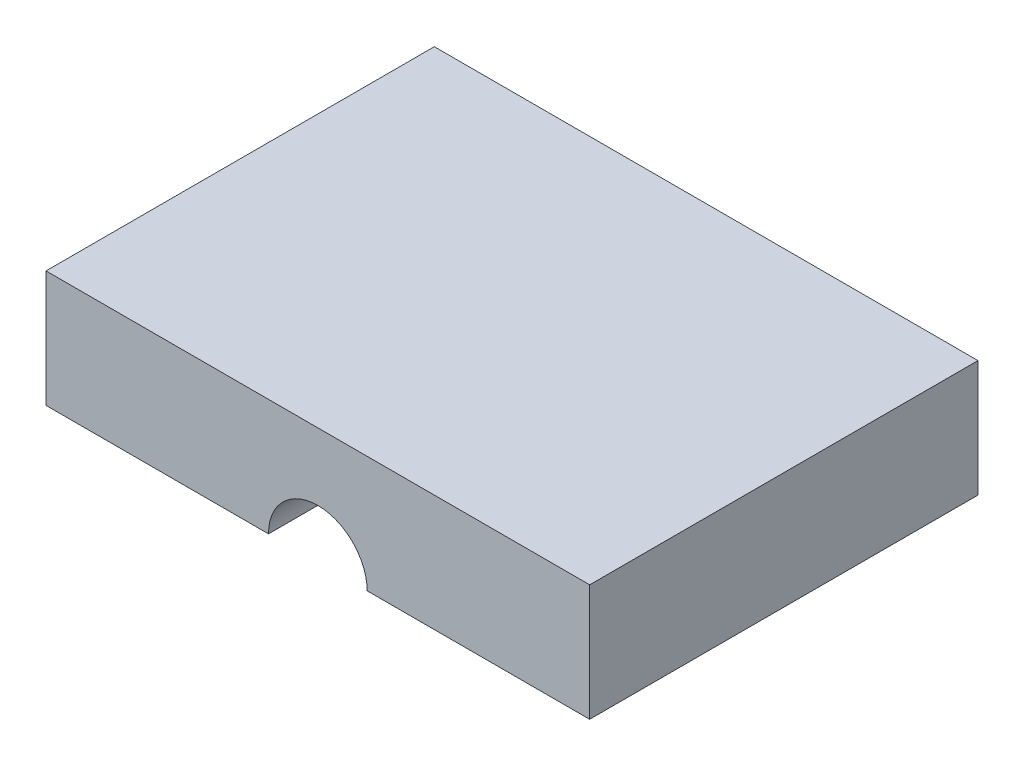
from build123d import *

# Parameters (mm, degrees)
BOSS_EXTRUDE1_DEPTH = 50


with BuildPart() as part:
    # Sketch1 → Boss-Extrude1 (new body)
    with BuildSketch(Plane.XY):
        with BuildLine():
            Line((35, 15), (-35, 15))
            Line((-35, 15), (-35, 0))
            Line((-35, 0), (-6.35, 0))
            ThreePointArc((-6.35, 0), (0, 6.35), (6.35, 0))
            Line((6.35, 0), (35, 0))
            Line((35, 0), (35, 15))
        make_face()
    extrude(amount=BOSS_EXTRUDE1_DEPTH)


solid = part.part
